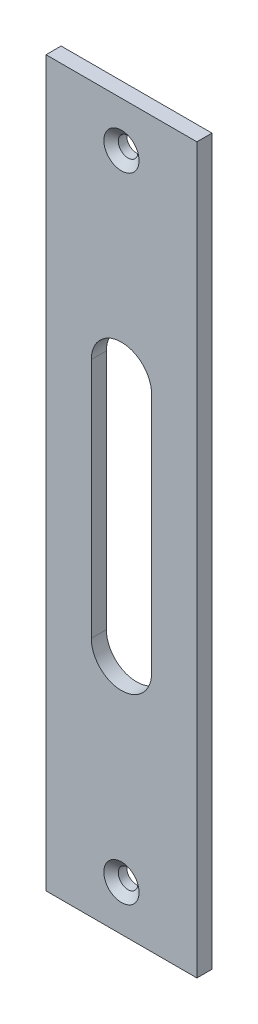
from build123d import *

# Parameters (mm, degrees)
SKETCH1_W                                         = 15.875
SKETCH1_H                                         = 76.2
BASE_EXTRUDE_DEPTH                                = 1.5875
CUT_EXTRUDE1_DEPTH                                = 39.950405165
CSK_FOR_1_FLAT_HEAD_MACHINE_SCREW_100_D           = 2.0574
CSK_FOR_1_FLAT_HEAD_MACHINE_SCREW_100_CSINK_D     = 3.7084
CSK_FOR_1_FLAT_HEAD_MACHINE_SCREW_100_CSINK_ANGLE = 100


with BuildPart() as part:
    # Sketch1 → Base-Extrude (new body)
    with BuildSketch(Plane.XY):
        Rectangle(SKETCH1_W, SKETCH1_H)
    extrude(amount=BASE_EXTRUDE_DEPTH)

    # Sketch2 → Cut-Extrude1 (cut, through all)
    with BuildSketch(Plane.XY.offset(1.5875)):
        with BuildLine():
            Line((3.175, 12.7), (3.175, -12.7))
            ThreePointArc((3.175, -12.7), (0, -15.875), (-3.175, -12.7))
            Line((-3.175, -12.7), (-3.175, 12.7))
            ThreePointArc((-3.175, 12.7), (0, 15.875), (3.175, 12.7))
        make_face()
    extrude(amount=-CUT_EXTRUDE1_DEPTH, mode=Mode.SUBTRACT)

    # CSK for _1 Flat Head Machine Screw _100 (through all)
    with Locations(Plane.XY.offset(1.5875)):
        with Locations((0, -33.3375), (0, 33.3375)):
            CounterSinkHole(CSK_FOR_1_FLAT_HEAD_MACHINE_SCREW_100_D / 2, CSK_FOR_1_FLAT_HEAD_MACHINE_SCREW_100_CSINK_D / 2, counter_sink_angle=CSK_FOR_1_FLAT_HEAD_MACHINE_SCREW_100_CSINK_ANGLE)


solid = part.part
